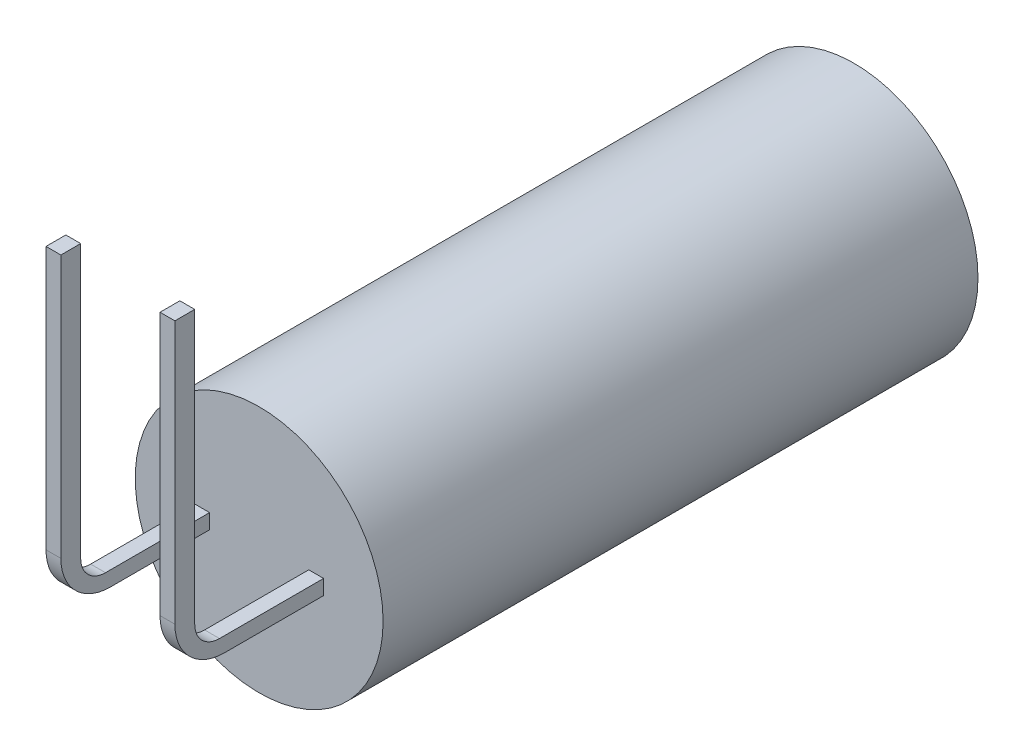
from build123d import *

# Parameters (mm, degrees)
ESQUISSE2_R      = 2.5
EXTRUSION1_DEPTH = 12
ESQUISSE5_W      = 0.3
ESQUISSE5_H      = 0.3
EXTRUSION3_DEPTH = 3
ESQUISSE6_W      = 0.3
ESQUISSE6_H      = 0.4
EXTRUSION4_DEPTH = 6
CONG_1_R         = 1
CONG_2_R         = 0.5


with BuildPart() as part:
    # Esquisse2 → Extrusion1 (new body)
    with BuildSketch(Plane.XY):
        Circle(ESQUISSE2_R)
    extrude(amount=-EXTRUSION1_DEPTH)

    # Esquisse5 → Extrusion3 (add)
    with BuildSketch(Plane.XY):
        with Locations((-1.15, 0)):
            Rectangle(ESQUISSE5_W, ESQUISSE5_H)
        with Locations((1.15, 0)):
            Rectangle(ESQUISSE5_W, ESQUISSE5_H)
    extrude(amount=EXTRUSION3_DEPTH)

    # Esquisse6 → Extrusion4 (add)
    with BuildSketch(Plane(origin=(0, 0.15, 0), x_dir=(-1, 0, 0), z_dir=(0, 1, 0))):
        with Locations((-1.15, 2.8)):
            Rectangle(ESQUISSE6_W, ESQUISSE6_H)
        with Locations((1.15, 2.8)):
            Rectangle(ESQUISSE6_W, ESQUISSE6_H)
    extrude(amount=EXTRUSION4_DEPTH)

    # Cong_1
    cong_1_edges = [part.edges().sort_by_distance(p)[0] for p in [
        (1.15, -0.15, 3),
        (-1.15, -0.15, 3),
    ]]
    fillet(cong_1_edges, radius=CONG_1_R)

    # Cong_2
    cong_2_edges = [part.edges().sort_by_distance(p)[0] for p in [
        (1.15, 0.15, 2.6),
        (-1.15, 0.15, 2.6),
    ]]
    fillet(cong_2_edges, radius=CONG_2_R)


solid = part.part
